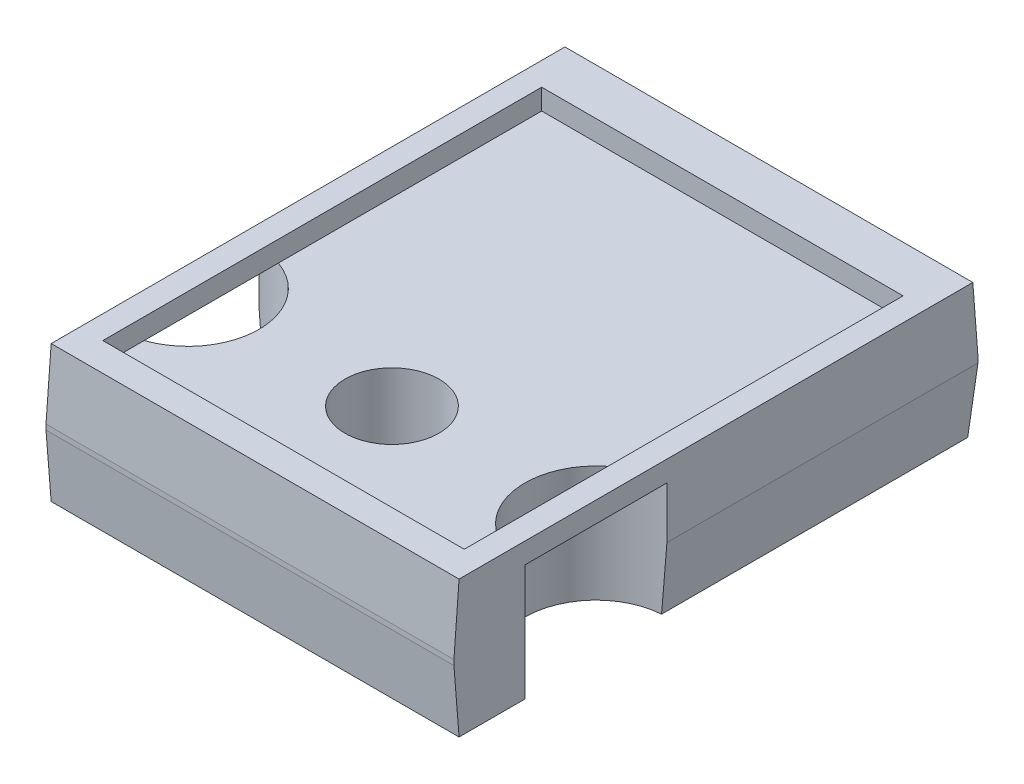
ISO-10303-21;
HEADER;
FILE_DESCRIPTION(('STEP AP214'),'2;1');
FILE_NAME('part.step','',(''),(''),'','','');
FILE_SCHEMA(('AUTOMOTIVE_DESIGN { 1 0 10303 214 1 1 1 1 }'));
ENDSEC;
DATA;
#1=APPLICATION_CONTEXT('core data for automotive mechanical design processes');
#2=APPLICATION_PROTOCOL_DEFINITION('international standard','automotive_design',2000,#1);
#3=PRODUCT_CONTEXT('',#1,'mechanical');
#4=PRODUCT('Part','Part','',(#3));
#5=PRODUCT_RELATED_PRODUCT_CATEGORY('part','',(#4));
#6=PRODUCT_DEFINITION_FORMATION('','',#4);
#7=PRODUCT_DEFINITION_CONTEXT('part definition',#1,'design');
#8=PRODUCT_DEFINITION('design','',#6,#7);
#9=PRODUCT_DEFINITION_SHAPE('','',#8);
#10=(LENGTH_UNIT() NAMED_UNIT(*) SI_UNIT(.MILLI.,.METRE.));
#11=(NAMED_UNIT(*) PLANE_ANGLE_UNIT() SI_UNIT($,.RADIAN.));
#12=(NAMED_UNIT(*) SI_UNIT($,.STERADIAN.) SOLID_ANGLE_UNIT());
#13=UNCERTAINTY_MEASURE_WITH_UNIT(LENGTH_MEASURE(1.E-05),#10,'distance_accuracy_value','');
#14=(GEOMETRIC_REPRESENTATION_CONTEXT(3) GLOBAL_UNCERTAINTY_ASSIGNED_CONTEXT((#13)) GLOBAL_UNIT_ASSIGNED_CONTEXT((#10,
#11,#12)) REPRESENTATION_CONTEXT('',''));
#15=CARTESIAN_POINT('',(0.,0.,0.));
#16=DIRECTION('',(0.,0.,1.));
#17=DIRECTION('',(1.,0.,0.));
#18=AXIS2_PLACEMENT_3D('',#15,#16,#17);
#19=CARTESIAN_POINT('',(14.9,4.5,6.3));
#20=DIRECTION('',(1.,0.,0.));
#21=DIRECTION('',(0.,0.,-1.));
#22=AXIS2_PLACEMENT_3D('',#19,#20,#21);
#23=PLANE('',#22);
#24=DIRECTION('',(0.,0.,-1.));
#25=VECTOR('',#24,1.);
#26=CARTESIAN_POINT('',(14.9,4.5,6.3));
#27=LINE('',#26,#25);
#28=CARTESIAN_POINT('',(14.9,4.5,23.3));
#29=VERTEX_POINT('',#28);
#30=CARTESIAN_POINT('',(14.9,4.5,21.6985572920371));
#31=VERTEX_POINT('',#30);
#32=EDGE_CURVE('E128',#29,#31,#27,.T.);
#33=ORIENTED_EDGE('',*,*,#32,.F.);
#34=DIRECTION('',(0.,1.,0.));
#35=VECTOR('',#34,1.);
#36=CARTESIAN_POINT('',(14.9,4.5,23.3));
#37=LINE('',#36,#35);
#38=CARTESIAN_POINT('',(14.9,5.3000000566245,23.3));
#39=VERTEX_POINT('',#38);
#40=EDGE_CURVE('E132',#29,#39,#37,.T.);
#41=ORIENTED_EDGE('',*,*,#40,.T.);
#42=DIRECTION('',(0.,0.,1.));
#43=VECTOR('',#42,1.);
#44=CARTESIAN_POINT('',(14.9,5.300000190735,4.3));
#45=LINE('',#44,#43);
#46=CARTESIAN_POINT('',(14.9,5.300000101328,6.3));
#47=VERTEX_POINT('',#46);
#48=EDGE_CURVE('E179',#47,#39,#45,.T.);
#49=ORIENTED_EDGE('',*,*,#48,.F.);
#50=DIRECTION('',(0.,1.,0.));
#51=VECTOR('',#50,1.);
#52=CARTESIAN_POINT('',(14.9,4.5,6.3));
#53=LINE('',#52,#51);
#54=CARTESIAN_POINT('',(14.9,4.5,6.3));
#55=VERTEX_POINT('',#54);
#56=EDGE_CURVE('E139',#55,#47,#53,.T.);
#57=ORIENTED_EDGE('',*,*,#56,.F.);
#58=DIRECTION('',(0.,0.,1.));
#59=VECTOR('',#58,1.);
#60=CARTESIAN_POINT('',(14.9,4.5,6.3));
#61=LINE('',#60,#59);
#62=CARTESIAN_POINT('',(14.9,4.5,16.5014427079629));
#63=VERTEX_POINT('',#62);
#64=EDGE_CURVE('E218',#63,#55,#61,.F.);
#65=ORIENTED_EDGE('',*,*,#64,.F.);
#66=DIRECTION('',(0.,0.,-1.));
#67=VECTOR('',#66,1.);
#68=CARTESIAN_POINT('',(14.9,4.5,19.1));
#69=LINE('',#68,#67);
#70=EDGE_CURVE('E135',#31,#63,#69,.T.);
#71=ORIENTED_EDGE('',*,*,#70,.F.);
#72=EDGE_LOOP('',(#33,#41,#49,#57,#65,#71));
#73=FACE_BOUND('',#72,.T.);
#74=ADVANCED_FACE('F16',(#73),#23,.F.);
#75=CARTESIAN_POINT('',(0.9,4.5,6.3));
#76=DIRECTION('',(0.,0.,1.));
#77=DIRECTION('',(1.,0.,0.));
#78=AXIS2_PLACEMENT_3D('',#75,#76,#77);
#79=PLANE('',#78);
#80=ORIENTED_EDGE('',*,*,#56,.T.);
#81=DIRECTION('',(1.,0.,0.));
#82=VECTOR('',#81,1.);
#83=CARTESIAN_POINT('',(0.,5.300000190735,6.3));
#84=LINE('',#83,#82);
#85=CARTESIAN_POINT('',(0.9,5.300000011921,6.3));
#86=VERTEX_POINT('',#85);
#87=EDGE_CURVE('E174',#86,#47,#84,.T.);
#88=ORIENTED_EDGE('',*,*,#87,.F.);
#89=DIRECTION('',(0.,1.,0.));
#90=VECTOR('',#89,1.);
#91=CARTESIAN_POINT('',(0.9,4.5,6.3));
#92=LINE('',#91,#90);
#93=CARTESIAN_POINT('',(0.9,4.5,6.3));
#94=VERTEX_POINT('',#93);
#95=EDGE_CURVE('E298',#94,#86,#92,.T.);
#96=ORIENTED_EDGE('',*,*,#95,.F.);
#97=DIRECTION('',(1.,0.,0.));
#98=VECTOR('',#97,1.);
#99=CARTESIAN_POINT('',(0.9,4.5,6.3));
#100=LINE('',#99,#98);
#101=EDGE_CURVE('E163',#55,#94,#100,.F.);
#102=ORIENTED_EDGE('',*,*,#101,.F.);
#103=EDGE_LOOP('',(#80,#88,#96,#102));
#104=FACE_BOUND('',#103,.T.);
#105=ADVANCED_FACE('F340',(#104),#79,.T.);
#106=CARTESIAN_POINT('',(0.9,4.5,6.3));
#107=DIRECTION('',(1.,0.,0.));
#108=DIRECTION('',(0.,0.,-1.));
#109=AXIS2_PLACEMENT_3D('',#106,#107,#108);
#110=PLANE('',#109);
#111=DIRECTION('',(0.,0.,-1.));
#112=VECTOR('',#111,1.);
#113=CARTESIAN_POINT('',(0.9,4.5,6.3));
#114=LINE('',#113,#112);
#115=CARTESIAN_POINT('',(0.9,4.5,23.3));
#116=VERTEX_POINT('',#115);
#117=CARTESIAN_POINT('',(0.9,4.5,21.6985572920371));
#118=VERTEX_POINT('',#117);
#119=EDGE_CURVE('E154',#116,#118,#114,.T.);
#120=ORIENTED_EDGE('',*,*,#119,.T.);
#121=DIRECTION('',(0.,0.,-1.));
#122=VECTOR('',#121,1.);
#123=CARTESIAN_POINT('',(0.9,4.5,19.1));
#124=LINE('',#123,#122);
#125=CARTESIAN_POINT('',(0.9,4.5,16.5014427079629));
#126=VERTEX_POINT('',#125);
#127=EDGE_CURVE('E239',#126,#118,#124,.F.);
#128=ORIENTED_EDGE('',*,*,#127,.F.);
#129=DIRECTION('',(0.,0.,1.));
#130=VECTOR('',#129,1.);
#131=CARTESIAN_POINT('',(0.9,4.5,6.3));
#132=LINE('',#131,#130);
#133=EDGE_CURVE('E157',#94,#126,#132,.T.);
#134=ORIENTED_EDGE('',*,*,#133,.F.);
#135=ORIENTED_EDGE('',*,*,#95,.T.);
#136=DIRECTION('',(0.,0.,1.));
#137=VECTOR('',#136,1.);
#138=CARTESIAN_POINT('',(0.9,5.300000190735,4.3));
#139=LINE('',#138,#137);
#140=CARTESIAN_POINT('',(0.9,5.3000000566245,23.3));
#141=VERTEX_POINT('',#140);
#142=EDGE_CURVE('E171',#141,#86,#139,.F.);
#143=ORIENTED_EDGE('',*,*,#142,.F.);
#144=DIRECTION('',(0.,1.,0.));
#145=VECTOR('',#144,1.);
#146=CARTESIAN_POINT('',(0.9,4.5,23.3));
#147=LINE('',#146,#145);
#148=EDGE_CURVE('E150',#141,#116,#147,.F.);
#149=ORIENTED_EDGE('',*,*,#148,.T.);
#150=EDGE_LOOP('',(#120,#128,#134,#135,#143,#149));
#151=FACE_BOUND('',#150,.T.);
#152=ADVANCED_FACE('F328',(#151),#110,.T.);
#153=CARTESIAN_POINT('',(0.9,4.5,23.3));
#154=DIRECTION('',(0.,0.,1.));
#155=DIRECTION('',(1.,0.,0.));
#156=AXIS2_PLACEMENT_3D('',#153,#154,#155);
#157=PLANE('',#156);
#158=ORIENTED_EDGE('',*,*,#40,.F.);
#159=DIRECTION('',(1.,0.,0.));
#160=VECTOR('',#159,1.);
#161=CARTESIAN_POINT('',(0.9,4.5,23.3));
#162=LINE('',#161,#160);
#163=EDGE_CURVE('E146',#116,#29,#162,.T.);
#164=ORIENTED_EDGE('',*,*,#163,.F.);
#165=ORIENTED_EDGE('',*,*,#148,.F.);
#166=DIRECTION('',(1.,0.,0.));
#167=VECTOR('',#166,1.);
#168=CARTESIAN_POINT('',(0.,5.300000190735,23.3));
#169=LINE('',#168,#167);
#170=EDGE_CURVE('E148',#39,#141,#169,.F.);
#171=ORIENTED_EDGE('',*,*,#170,.F.);
#172=EDGE_LOOP('',(#158,#164,#165,#171));
#173=FACE_BOUND('',#172,.T.);
#174=ADVANCED_FACE('F144',(#173),#157,.F.);
#175=CARTESIAN_POINT('',(0.,0.,4.3));
#176=DIRECTION('',(0.,0.,1.));
#177=DIRECTION('',(1.,0.,0.));
#178=AXIS2_PLACEMENT_3D('',#175,#176,#177);
#179=PLANE('',#178);
#180=DIRECTION('',(0.,1.,0.));
#181=VECTOR('',#180,1.);
#182=CARTESIAN_POINT('',(15.800000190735,0.,4.3));
#183=LINE('',#182,#181);
#184=CARTESIAN_POINT('',(15.800000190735,2.5,4.3));
#185=VERTEX_POINT('',#184);
#186=CARTESIAN_POINT('',(15.800000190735,2.70000019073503,4.30000000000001));
#187=VERTEX_POINT('',#186);
#188=EDGE_CURVE('E251',#185,#187,#183,.T.);
#189=ORIENTED_EDGE('',*,*,#188,.F.);
#190=DIRECTION('',(1.,0.,0.));
#191=VECTOR('',#190,1.);
#192=CARTESIAN_POINT('',(0.,2.5,4.29999999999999));
#193=LINE('',#192,#191);
#194=CARTESIAN_POINT('',(0.,2.5,4.3));
#195=VERTEX_POINT('',#194);
#196=EDGE_CURVE('E156',#195,#185,#193,.T.);
#197=ORIENTED_EDGE('',*,*,#196,.F.);
#198=DIRECTION('',(0.,1.,0.));
#199=VECTOR('',#198,1.);
#200=CARTESIAN_POINT('',(0.,0.,4.3));
#201=LINE('',#200,#199);
#202=CARTESIAN_POINT('',(0.,2.70000019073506,4.30000000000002));
#203=VERTEX_POINT('',#202);
#204=EDGE_CURVE('E149',#203,#195,#201,.F.);
#205=ORIENTED_EDGE('',*,*,#204,.F.);
#206=DIRECTION('',(1.,0.,0.));
#207=VECTOR('',#206,1.);
#208=CARTESIAN_POINT('',(0.,2.700000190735,4.30000000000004));
#209=LINE('',#208,#207);
#210=EDGE_CURVE('E238',#203,#187,#209,.T.);
#211=ORIENTED_EDGE('',*,*,#210,.T.);
#212=EDGE_LOOP('',(#189,#197,#205,#211));
#213=FACE_BOUND('',#212,.T.);
#214=ADVANCED_FACE('F432',(#213),#179,.F.);
#215=CARTESIAN_POINT('',(0.,4.5,19.1));
#216=DIRECTION('',(0.,-1.,0.));
#217=DIRECTION('',(0.,0.,-1.));
#218=AXIS2_PLACEMENT_3D('',#215,#216,#217);
#219=PLANE('',#218);
#220=DIRECTION('',(0.,0.,-1.));
#221=VECTOR('',#220,1.);
#222=CARTESIAN_POINT('',(0.,4.5,4.3));
#223=LINE('',#222,#221);
#224=CARTESIAN_POINT('',(0.,4.5,21.85));
#225=VERTEX_POINT('',#224);
#226=CARTESIAN_POINT('',(0.,4.5,16.35));
#227=VERTEX_POINT('',#226);
#228=EDGE_CURVE('E252',#225,#227,#223,.T.);
#229=ORIENTED_EDGE('',*,*,#228,.T.);
#230=CARTESIAN_POINT('',(0.,4.5,19.1));
#231=DIRECTION('',(0.,-1.,0.));
#232=DIRECTION('',(0.,0.,-1.));
#233=AXIS2_PLACEMENT_3D('',#230,#231,#232);
#234=CIRCLE('',#233,2.75);
#235=EDGE_CURVE('E215',#227,#126,#234,.T.);
#236=ORIENTED_EDGE('',*,*,#235,.T.);
#237=ORIENTED_EDGE('',*,*,#127,.T.);
#238=CARTESIAN_POINT('',(0.,4.5,19.1));
#239=DIRECTION('',(0.,-1.,0.));
#240=DIRECTION('',(0.,0.,-1.));
#241=AXIS2_PLACEMENT_3D('',#238,#239,#240);
#242=CIRCLE('',#241,2.75);
#243=EDGE_CURVE('E208',#118,#225,#242,.T.);
#244=ORIENTED_EDGE('',*,*,#243,.T.);
#245=EDGE_LOOP('',(#229,#236,#237,#244));
#246=FACE_BOUND('',#245,.T.);
#247=ADVANCED_FACE('F590',(#246),#219,.T.);
#248=CARTESIAN_POINT('',(0.,0.,24.599999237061));
#249=DIRECTION('',(0.,0.,1.));
#250=DIRECTION('',(1.,0.,0.));
#251=AXIS2_PLACEMENT_3D('',#248,#249,#250);
#252=PLANE('',#251);
#253=DIRECTION('',(0.,1.,0.));
#254=VECTOR('',#253,1.);
#255=CARTESIAN_POINT('',(15.800000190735,0.,24.599999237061));
#256=LINE('',#255,#254);
#257=CARTESIAN_POINT('',(15.800000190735,2.49999999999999,24.599999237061));
#258=VERTEX_POINT('',#257);
#259=CARTESIAN_POINT('',(15.800000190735,2.70000019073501,24.599999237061));
#260=VERTEX_POINT('',#259);
#261=EDGE_CURVE('E90',#258,#260,#256,.T.);
#262=ORIENTED_EDGE('',*,*,#261,.T.);
#263=DIRECTION('',(1.,0.,0.));
#264=VECTOR('',#263,1.);
#265=CARTESIAN_POINT('',(0.,2.700000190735,24.599999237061));
#266=LINE('',#265,#264);
#267=CARTESIAN_POINT('',(0.,2.70000019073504,24.599999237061));
#268=VERTEX_POINT('',#267);
#269=EDGE_CURVE('E183',#268,#260,#266,.T.);
#270=ORIENTED_EDGE('',*,*,#269,.F.);
#271=DIRECTION('',(0.,1.,0.));
#272=VECTOR('',#271,1.);
#273=CARTESIAN_POINT('',(0.,0.,24.599999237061));
#274=LINE('',#273,#272);
#275=CARTESIAN_POINT('',(0.,2.49999999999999,24.599999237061));
#276=VERTEX_POINT('',#275);
#277=EDGE_CURVE('E242',#268,#276,#274,.F.);
#278=ORIENTED_EDGE('',*,*,#277,.T.);
#279=DIRECTION('',(1.,0.,0.));
#280=VECTOR('',#279,1.);
#281=CARTESIAN_POINT('',(0.,2.5,24.599999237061));
#282=LINE('',#281,#280);
#283=EDGE_CURVE('E229',#276,#258,#282,.T.);
#284=ORIENTED_EDGE('',*,*,#283,.T.);
#285=EDGE_LOOP('',(#262,#270,#278,#284));
#286=FACE_BOUND('',#285,.T.);
#287=ADVANCED_FACE('F454',(#286),#252,.T.);
#288=CARTESIAN_POINT('',(0.,4.000000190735,4.4));
#289=DIRECTION('',(0.,-0.076696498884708,0.997054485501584));
#290=DIRECTION('',(0.,-0.997054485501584,-0.076696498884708));
#291=AXIS2_PLACEMENT_3D('',#288,#289,#290);
#292=PLANE('',#291);
#293=DIRECTION('',(1.,0.,0.));
#294=VECTOR('',#293,1.);
#295=CARTESIAN_POINT('',(0.,5.300000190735,4.5));
#296=LINE('',#295,#294);
#297=CARTESIAN_POINT('',(15.800000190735,5.300000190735,4.49999999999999));
#298=VERTEX_POINT('',#297);
#299=CARTESIAN_POINT('',(0.,5.300000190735,4.5));
#300=VERTEX_POINT('',#299);
#301=EDGE_CURVE('E236',#298,#300,#296,.F.);
#302=ORIENTED_EDGE('',*,*,#301,.F.);
#303=DIRECTION('',(0.,0.997054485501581,0.0766964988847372));
#304=VECTOR('',#303,1.);
#305=CARTESIAN_POINT('',(15.800000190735,2.700000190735,4.3));
#306=LINE('',#305,#304);
#307=EDGE_CURVE('E231',#187,#298,#306,.T.);
#308=ORIENTED_EDGE('',*,*,#307,.F.);
#309=ORIENTED_EDGE('',*,*,#210,.F.);
#310=DIRECTION('',(0.,0.997054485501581,0.0766964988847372));
#311=VECTOR('',#310,1.);
#312=CARTESIAN_POINT('',(0.,2.700000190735,4.3));
#313=LINE('',#312,#311);
#314=EDGE_CURVE('E273',#203,#300,#313,.T.);
#315=ORIENTED_EDGE('',*,*,#314,.T.);
#316=EDGE_LOOP('',(#302,#308,#309,#315));
#317=FACE_BOUND('',#316,.T.);
#318=ADVANCED_FACE('F448',(#317),#292,.F.);
#319=CARTESIAN_POINT('',(0.,5.300000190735,4.3));
#320=DIRECTION('',(0.,1.,0.));
#321=DIRECTION('',(0.,0.,1.));
#322=AXIS2_PLACEMENT_3D('',#319,#320,#321);
#323=PLANE('',#322);
#324=ORIENTED_EDGE('',*,*,#87,.T.);
#325=ORIENTED_EDGE('',*,*,#48,.T.);
#326=ORIENTED_EDGE('',*,*,#170,.T.);
#327=ORIENTED_EDGE('',*,*,#142,.T.);
#328=EDGE_LOOP('',(#324,#325,#326,#327));
#329=FACE_BOUND('',#328,.T.);
#330=DIRECTION('',(0.,0.,-1.));
#331=VECTOR('',#330,1.);
#332=CARTESIAN_POINT('',(0.,5.300000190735,4.3));
#333=LINE('',#332,#331);
#334=CARTESIAN_POINT('',(0.,5.300000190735,24.399999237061));
#335=VERTEX_POINT('',#334);
#336=EDGE_CURVE('E260',#300,#335,#333,.F.);
#337=ORIENTED_EDGE('',*,*,#336,.T.);
#338=DIRECTION('',(1.,0.,0.));
#339=VECTOR('',#338,1.);
#340=CARTESIAN_POINT('',(0.,5.300000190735,24.399999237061));
#341=LINE('',#340,#339);
#342=CARTESIAN_POINT('',(15.800000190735,5.300000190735,24.399999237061));
#343=VERTEX_POINT('',#342);
#344=EDGE_CURVE('E224',#343,#335,#341,.F.);
#345=ORIENTED_EDGE('',*,*,#344,.F.);
#346=DIRECTION('',(0.,0.,-1.));
#347=VECTOR('',#346,1.);
#348=CARTESIAN_POINT('',(15.800000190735,5.300000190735,4.3));
#349=LINE('',#348,#347);
#350=EDGE_CURVE('E310',#298,#343,#349,.F.);
#351=ORIENTED_EDGE('',*,*,#350,.F.);
#352=ORIENTED_EDGE('',*,*,#301,.T.);
#353=EDGE_LOOP('',(#337,#345,#351,#352));
#354=FACE_BOUND('',#353,.T.);
#355=ADVANCED_FACE('F332',(#329,#354),#323,.T.);
#356=CARTESIAN_POINT('',(0.,4.000000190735,24.499999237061));
#357=DIRECTION('',(0.,0.076696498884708,0.997054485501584));
#358=DIRECTION('',(0.,-0.997054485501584,0.076696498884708));
#359=AXIS2_PLACEMENT_3D('',#356,#357,#358);
#360=PLANE('',#359);
#361=ORIENTED_EDGE('',*,*,#344,.T.);
#362=DIRECTION('',(0.,-0.997054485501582,0.0766964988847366));
#363=VECTOR('',#362,1.);
#364=CARTESIAN_POINT('',(0.,5.300000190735,24.399999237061));
#365=LINE('',#364,#363);
#366=EDGE_CURVE('E246',#335,#268,#365,.T.);
#367=ORIENTED_EDGE('',*,*,#366,.T.);
#368=ORIENTED_EDGE('',*,*,#269,.T.);
#369=DIRECTION('',(0.,-0.997054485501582,0.0766964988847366));
#370=VECTOR('',#369,1.);
#371=CARTESIAN_POINT('',(15.800000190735,5.300000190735,24.399999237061));
#372=LINE('',#371,#370);
#373=EDGE_CURVE('E313',#343,#260,#372,.T.);
#374=ORIENTED_EDGE('',*,*,#373,.F.);
#375=EDGE_LOOP('',(#361,#367,#368,#374));
#376=FACE_BOUND('',#375,.T.);
#377=ADVANCED_FACE('F452',(#376),#360,.T.);
#378=CARTESIAN_POINT('',(15.8,4.5,19.1));
#379=DIRECTION('',(0.,-1.,0.));
#380=DIRECTION('',(0.,0.,-1.));
#381=AXIS2_PLACEMENT_3D('',#378,#379,#380);
#382=PLANE('',#381);
#383=ORIENTED_EDGE('',*,*,#70,.T.);
#384=CARTESIAN_POINT('',(15.8,4.5,19.1));
#385=DIRECTION('',(0.,-1.,0.));
#386=DIRECTION('',(0.,0.,-1.));
#387=AXIS2_PLACEMENT_3D('',#384,#385,#386);
#388=CIRCLE('',#387,2.75);
#389=CARTESIAN_POINT('',(15.8000000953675,4.5,16.35));
#390=VERTEX_POINT('',#389);
#391=EDGE_CURVE('E217',#63,#390,#388,.T.);
#392=ORIENTED_EDGE('',*,*,#391,.T.);
#393=DIRECTION('',(0.,0.,-1.));
#394=VECTOR('',#393,1.);
#395=CARTESIAN_POINT('',(15.800000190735,4.5,4.3));
#396=LINE('',#395,#394);
#397=CARTESIAN_POINT('',(15.800000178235,4.5,21.85));
#398=VERTEX_POINT('',#397);
#399=EDGE_CURVE('E227',#398,#390,#396,.T.);
#400=ORIENTED_EDGE('',*,*,#399,.F.);
#401=CARTESIAN_POINT('',(15.8,4.5,19.1));
#402=DIRECTION('',(0.,-1.,0.));
#403=DIRECTION('',(0.,0.,-1.));
#404=AXIS2_PLACEMENT_3D('',#401,#402,#403);
#405=CIRCLE('',#404,2.75);
#406=EDGE_CURVE('E19',#398,#31,#405,.T.);
#407=ORIENTED_EDGE('',*,*,#406,.T.);
#408=EDGE_LOOP('',(#383,#392,#400,#407));
#409=FACE_BOUND('',#408,.T.);
#410=ADVANCED_FACE('F344',(#409),#382,.T.);
#411=CARTESIAN_POINT('',(0.9,4.5,6.3));
#412=DIRECTION('',(0.,1.,0.));
#413=DIRECTION('',(0.,0.,1.));
#414=AXIS2_PLACEMENT_3D('',#411,#412,#413);
#415=PLANE('',#414);
#416=CARTESIAN_POINT('',(7.9,4.5,19.1));
#417=DIRECTION('',(0.,-1.,0.));
#418=DIRECTION('',(0.,0.,-1.));
#419=AXIS2_PLACEMENT_3D('',#416,#417,#418);
#420=CIRCLE('',#419,1.820000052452);
#421=CARTESIAN_POINT('',(7.9,4.5,17.279999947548));
#422=VERTEX_POINT('',#421);
#423=EDGE_CURVE('E197',#422,#422,#420,.T.);
#424=ORIENTED_EDGE('',*,*,#423,.T.);
#425=EDGE_LOOP('',(#424));
#426=FACE_BOUND('',#425,.T.);
#427=ORIENTED_EDGE('',*,*,#32,.T.);
#428=CARTESIAN_POINT('',(15.8,4.5,19.1));
#429=DIRECTION('',(0.,-1.,0.));
#430=DIRECTION('',(0.,0.,-1.));
#431=AXIS2_PLACEMENT_3D('',#428,#429,#430);
#432=CIRCLE('',#431,2.75);
#433=EDGE_CURVE('E204',#31,#63,#432,.T.);
#434=ORIENTED_EDGE('',*,*,#433,.T.);
#435=ORIENTED_EDGE('',*,*,#64,.T.);
#436=ORIENTED_EDGE('',*,*,#101,.T.);
#437=ORIENTED_EDGE('',*,*,#133,.T.);
#438=CARTESIAN_POINT('',(0.,4.5,19.1));
#439=DIRECTION('',(0.,-1.,0.));
#440=DIRECTION('',(0.,0.,-1.));
#441=AXIS2_PLACEMENT_3D('',#438,#439,#440);
#442=CIRCLE('',#441,2.75);
#443=EDGE_CURVE('E211',#126,#118,#442,.T.);
#444=ORIENTED_EDGE('',*,*,#443,.T.);
#445=ORIENTED_EDGE('',*,*,#119,.F.);
#446=ORIENTED_EDGE('',*,*,#163,.T.);
#447=EDGE_LOOP('',(#427,#434,#435,#436,#437,#444,#445,#446));
#448=FACE_BOUND('',#447,.T.);
#449=ADVANCED_FACE('F152',(#426,#448),#415,.T.);
#450=CARTESIAN_POINT('',(0.,1.25,4.4));
#451=DIRECTION('',(0.,-0.0797452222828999,-0.996815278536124));
#452=DIRECTION('',(0.,0.996815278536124,-0.0797452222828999));
#453=AXIS2_PLACEMENT_3D('',#450,#451,#452);
#454=PLANE('',#453);
#455=ORIENTED_EDGE('',*,*,#196,.T.);
#456=DIRECTION('',(-0.0794928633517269,-0.993660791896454,0.0794928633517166));
#457=VECTOR('',#456,1.);
#458=CARTESIAN_POINT('',(15.800000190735,2.5,4.3));
#459=LINE('',#458,#457);
#460=CARTESIAN_POINT('',(15.600000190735,0.,4.5));
#461=VERTEX_POINT('',#460);
#462=EDGE_CURVE('E203',#185,#461,#459,.T.);
#463=ORIENTED_EDGE('',*,*,#462,.T.);
#464=DIRECTION('',(1.,0.,0.));
#465=VECTOR('',#464,1.);
#466=CARTESIAN_POINT('',(0.,0.,4.5));
#467=LINE('',#466,#465);
#468=CARTESIAN_POINT('',(0.200000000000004,0.,4.5));
#469=VERTEX_POINT('',#468);
#470=EDGE_CURVE('E200',#461,#469,#467,.F.);
#471=ORIENTED_EDGE('',*,*,#470,.T.);
#472=DIRECTION('',(0.0794928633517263,-0.993660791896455,0.0794928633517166));
#473=VECTOR('',#472,1.);
#474=CARTESIAN_POINT('',(0.,2.5,4.3));
#475=LINE('',#474,#473);
#476=EDGE_CURVE('E160',#195,#469,#475,.T.);
#477=ORIENTED_EDGE('',*,*,#476,.F.);
#478=EDGE_LOOP('',(#455,#463,#471,#477));
#479=FACE_BOUND('',#478,.T.);
#480=ADVANCED_FACE('F433',(#479),#454,.T.);
#481=CARTESIAN_POINT('',(0.1,1.25,4.5));
#482=DIRECTION('',(-0.996815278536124,-0.0797452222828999,0.));
#483=DIRECTION('',(0.0797452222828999,-0.996815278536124,0.));
#484=AXIS2_PLACEMENT_3D('',#481,#482,#483);
#485=PLANE('',#484);
#486=DIRECTION('',(0.,0.,-1.));
#487=VECTOR('',#486,1.);
#488=CARTESIAN_POINT('',(0.,2.5,4.3));
#489=LINE('',#488,#487);
#490=CARTESIAN_POINT('',(0.,2.49999999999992,16.35));
#491=VERTEX_POINT('',#490);
#492=EDGE_CURVE('E257',#491,#195,#489,.T.);
#493=ORIENTED_EDGE('',*,*,#492,.T.);
#494=ORIENTED_EDGE('',*,*,#476,.T.);
#495=DIRECTION('',(0.,0.,1.));
#496=VECTOR('',#495,1.);
#497=CARTESIAN_POINT('',(0.2,0.,4.3));
#498=LINE('',#497,#496);
#499=CARTESIAN_POINT('',(0.200000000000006,0.,16.3572823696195));
#500=VERTEX_POINT('',#499);
#501=EDGE_CURVE('E196',#469,#500,#498,.T.);
#502=ORIENTED_EDGE('',*,*,#501,.T.);
#503=CARTESIAN_POINT('',(0.,2.49999999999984,19.1));
#504=DIRECTION('',(-0.996815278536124,-0.0797452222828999,0.));
#505=DIRECTION('',(0.0797452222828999,-0.996815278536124,0.));
#506=AXIS2_PLACEMENT_3D('',#503,#504,#505);
#507=ELLIPSE('',#506,34.4848245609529,2.75);
#508=EDGE_CURVE('E213',#500,#491,#507,.F.);
#509=ORIENTED_EDGE('',*,*,#508,.T.);
#510=EDGE_LOOP('',(#493,#494,#502,#509));
#511=FACE_BOUND('',#510,.T.);
#512=ADVANCED_FACE('F426',(#511),#485,.T.);
#513=CARTESIAN_POINT('',(0.,4.5,19.1));
#514=DIRECTION('',(0.,-1.,0.));
#515=DIRECTION('',(0.,0.,-1.));
#516=AXIS2_PLACEMENT_3D('',#513,#514,#515);
#517=CYLINDRICAL_SURFACE('',#516,2.75);
#518=CARTESIAN_POINT('',(0.,0.,19.1));
#519=DIRECTION('',(0.,-1.,0.));
#520=DIRECTION('',(0.,0.,-1.));
#521=AXIS2_PLACEMENT_3D('',#518,#519,#520);
#522=CIRCLE('',#521,2.75);
#523=CARTESIAN_POINT('',(0.,0.,21.85));
#524=VERTEX_POINT('',#523);
#525=EDGE_CURVE('E192',#500,#524,#522,.T.);
#526=ORIENTED_EDGE('',*,*,#525,.T.);
#527=DIRECTION('',(0.,1.,0.));
#528=VECTOR('',#527,1.);
#529=CARTESIAN_POINT('',(0.,0.,21.85));
#530=LINE('',#529,#528);
#531=EDGE_CURVE('E245',#524,#225,#530,.T.);
#532=ORIENTED_EDGE('',*,*,#531,.T.);
#533=ORIENTED_EDGE('',*,*,#243,.F.);
#534=ORIENTED_EDGE('',*,*,#443,.F.);
#535=ORIENTED_EDGE('',*,*,#235,.F.);
#536=DIRECTION('',(0.,1.,0.));
#537=VECTOR('',#536,1.);
#538=CARTESIAN_POINT('',(0.,0.,16.35));
#539=LINE('',#538,#537);
#540=EDGE_CURVE('E210',#227,#491,#539,.F.);
#541=ORIENTED_EDGE('',*,*,#540,.T.);
#542=ORIENTED_EDGE('',*,*,#508,.F.);
#543=EDGE_LOOP('',(#526,#532,#533,#534,#535,#541,#542));
#544=FACE_BOUND('',#543,.T.);
#545=ADVANCED_FACE('F422',(#544),#517,.F.);
#546=CARTESIAN_POINT('',(0.,0.,4.3));
#547=DIRECTION('',(1.,0.,0.));
#548=DIRECTION('',(0.,0.,-1.));
#549=AXIS2_PLACEMENT_3D('',#546,#547,#548);
#550=PLANE('',#549);
#551=ORIENTED_EDGE('',*,*,#531,.F.);
#552=DIRECTION('',(0.,0.,1.));
#553=VECTOR('',#552,1.);
#554=CARTESIAN_POINT('',(0.,0.,4.3));
#555=LINE('',#554,#553);
#556=CARTESIAN_POINT('',(0.,0.,24.399999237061));
#557=VERTEX_POINT('',#556);
#558=EDGE_CURVE('E195',#524,#557,#555,.T.);
#559=ORIENTED_EDGE('',*,*,#558,.T.);
#560=DIRECTION('',(0.,0.996815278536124,0.0797452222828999));
#561=VECTOR('',#560,1.);
#562=CARTESIAN_POINT('',(0.,1.25,24.499999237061));
#563=LINE('',#562,#561);
#564=EDGE_CURVE('E232',#557,#276,#563,.T.);
#565=ORIENTED_EDGE('',*,*,#564,.T.);
#566=ORIENTED_EDGE('',*,*,#277,.F.);
#567=ORIENTED_EDGE('',*,*,#366,.F.);
#568=ORIENTED_EDGE('',*,*,#336,.F.);
#569=ORIENTED_EDGE('',*,*,#314,.F.);
#570=ORIENTED_EDGE('',*,*,#204,.T.);
#571=ORIENTED_EDGE('',*,*,#492,.F.);
#572=ORIENTED_EDGE('',*,*,#540,.F.);
#573=ORIENTED_EDGE('',*,*,#228,.F.);
#574=EDGE_LOOP('',(#551,#559,#565,#566,#567,#568,#569,#570,#571,#572,#573));
#575=FACE_BOUND('',#574,.T.);
#576=ADVANCED_FACE('F415',(#575),#550,.F.);
#577=CARTESIAN_POINT('',(0.,1.25,24.499999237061));
#578=DIRECTION('',(0.,0.0797452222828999,-0.996815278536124));
#579=DIRECTION('',(0.,0.996815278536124,0.0797452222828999));
#580=AXIS2_PLACEMENT_3D('',#577,#578,#579);
#581=PLANE('',#580);
#582=DIRECTION('',(0.,-0.996815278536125,-0.0797452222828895));
#583=VECTOR('',#582,1.);
#584=CARTESIAN_POINT('',(15.800000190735,2.5,24.599999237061));
#585=LINE('',#584,#583);
#586=CARTESIAN_POINT('',(15.800000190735,0.,24.399999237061));
#587=VERTEX_POINT('',#586);
#588=EDGE_CURVE('E317',#258,#587,#585,.T.);
#589=ORIENTED_EDGE('',*,*,#588,.F.);
#590=ORIENTED_EDGE('',*,*,#283,.F.);
#591=ORIENTED_EDGE('',*,*,#564,.F.);
#592=DIRECTION('',(1.,0.,0.));
#593=VECTOR('',#592,1.);
#594=CARTESIAN_POINT('',(0.,0.,24.399999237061));
#595=LINE('',#594,#593);
#596=EDGE_CURVE('E358',#557,#587,#595,.T.);
#597=ORIENTED_EDGE('',*,*,#596,.T.);
#598=EDGE_LOOP('',(#589,#590,#591,#597));
#599=FACE_BOUND('',#598,.T.);
#600=ADVANCED_FACE('F458',(#599),#581,.F.);
#601=CARTESIAN_POINT('',(15.800000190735,0.,4.3));
#602=DIRECTION('',(1.,0.,0.));
#603=DIRECTION('',(0.,0.,-1.));
#604=AXIS2_PLACEMENT_3D('',#601,#602,#603);
#605=PLANE('',#604);
#606=DIRECTION('',(0.,-1.,0.));
#607=VECTOR('',#606,1.);
#608=CARTESIAN_POINT('',(15.800000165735,4.5,21.85));
#609=LINE('',#608,#607);
#610=CARTESIAN_POINT('',(15.800000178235,0.,21.85));
#611=VERTEX_POINT('',#610);
#612=EDGE_CURVE('E207',#611,#398,#609,.F.);
#613=ORIENTED_EDGE('',*,*,#612,.T.);
#614=ORIENTED_EDGE('',*,*,#399,.T.);
#615=DIRECTION('',(0.,-1.,0.));
#616=VECTOR('',#615,1.);
#617=CARTESIAN_POINT('',(15.8,4.5,16.35));
#618=LINE('',#617,#616);
#619=CARTESIAN_POINT('',(15.8000000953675,2.49999880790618,16.35));
#620=VERTEX_POINT('',#619);
#621=EDGE_CURVE('E206',#390,#620,#618,.T.);
#622=ORIENTED_EDGE('',*,*,#621,.T.);
#623=DIRECTION('',(0.,0.,1.));
#624=VECTOR('',#623,1.);
#625=CARTESIAN_POINT('',(15.800000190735,2.5,4.5));
#626=LINE('',#625,#624);
#627=EDGE_CURVE('E201',#620,#185,#626,.F.);
#628=ORIENTED_EDGE('',*,*,#627,.T.);
#629=ORIENTED_EDGE('',*,*,#188,.T.);
#630=ORIENTED_EDGE('',*,*,#307,.T.);
#631=ORIENTED_EDGE('',*,*,#350,.T.);
#632=ORIENTED_EDGE('',*,*,#373,.T.);
#633=ORIENTED_EDGE('',*,*,#261,.F.);
#634=ORIENTED_EDGE('',*,*,#588,.T.);
#635=DIRECTION('',(0.,0.,1.));
#636=VECTOR('',#635,1.);
#637=CARTESIAN_POINT('',(15.800000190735,0.,4.3));
#638=LINE('',#637,#636);
#639=EDGE_CURVE('E191',#587,#611,#638,.F.);
#640=ORIENTED_EDGE('',*,*,#639,.T.);
#641=EDGE_LOOP('',(#613,#614,#622,#628,#629,#630,#631,#632,#633,#634,#640));
#642=FACE_BOUND('',#641,.T.);
#643=ADVANCED_FACE('F347',(#642),#605,.T.);
#644=CARTESIAN_POINT('',(15.8,4.5,19.1));
#645=DIRECTION('',(0.,-1.,0.));
#646=DIRECTION('',(0.,0.,-1.));
#647=AXIS2_PLACEMENT_3D('',#644,#645,#646);
#648=CYLINDRICAL_SURFACE('',#647,2.75);
#649=ORIENTED_EDGE('',*,*,#621,.F.);
#650=ORIENTED_EDGE('',*,*,#391,.F.);
#651=ORIENTED_EDGE('',*,*,#433,.F.);
#652=ORIENTED_EDGE('',*,*,#406,.F.);
#653=ORIENTED_EDGE('',*,*,#612,.F.);
#654=CARTESIAN_POINT('',(15.8,0.,19.1));
#655=DIRECTION('',(0.,-1.,0.));
#656=DIRECTION('',(0.,0.,-1.));
#657=AXIS2_PLACEMENT_3D('',#654,#655,#656);
#658=CIRCLE('',#657,2.75);
#659=CARTESIAN_POINT('',(15.600000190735,0.,16.357282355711));
#660=VERTEX_POINT('',#659);
#661=EDGE_CURVE('E188',#611,#660,#658,.T.);
#662=ORIENTED_EDGE('',*,*,#661,.T.);
#663=CARTESIAN_POINT('',(15.8,2.49999761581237,19.1));
#664=DIRECTION('',(-0.996815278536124,0.0797452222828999,0.));
#665=DIRECTION('',(-0.0797452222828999,-0.996815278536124,0.));
#666=AXIS2_PLACEMENT_3D('',#663,#664,#665);
#667=ELLIPSE('',#666,34.4848245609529,2.75);
#668=EDGE_CURVE('E34',#660,#620,#667,.F.);
#669=ORIENTED_EDGE('',*,*,#668,.T.);
#670=EDGE_LOOP('',(#649,#650,#651,#652,#653,#662,#669));
#671=FACE_BOUND('',#670,.T.);
#672=ADVANCED_FACE('F343',(#671),#648,.F.);
#673=CARTESIAN_POINT('',(15.700000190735,1.25,4.5));
#674=DIRECTION('',(-0.996815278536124,0.0797452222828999,0.));
#675=DIRECTION('',(-0.0797452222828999,-0.996815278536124,0.));
#676=AXIS2_PLACEMENT_3D('',#673,#674,#675);
#677=PLANE('',#676);
#678=ORIENTED_EDGE('',*,*,#668,.F.);
#679=DIRECTION('',(0.,0.,1.));
#680=VECTOR('',#679,1.);
#681=CARTESIAN_POINT('',(15.600000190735,0.,4.3));
#682=LINE('',#681,#680);
#683=EDGE_CURVE('E25',#660,#461,#682,.F.);
#684=ORIENTED_EDGE('',*,*,#683,.T.);
#685=ORIENTED_EDGE('',*,*,#462,.F.);
#686=ORIENTED_EDGE('',*,*,#627,.F.);
#687=EDGE_LOOP('',(#678,#684,#685,#686));
#688=FACE_BOUND('',#687,.T.);
#689=ADVANCED_FACE('F400',(#688),#677,.F.);
#690=CARTESIAN_POINT('',(7.9,4.5,19.1));
#691=DIRECTION('',(0.,-1.,0.));
#692=DIRECTION('',(0.,0.,-1.));
#693=AXIS2_PLACEMENT_3D('',#690,#691,#692);
#694=CYLINDRICAL_SURFACE('',#693,1.820000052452);
#695=ORIENTED_EDGE('',*,*,#423,.F.);
#696=EDGE_LOOP('',(#695));
#697=FACE_BOUND('',#696,.T.);
#698=CARTESIAN_POINT('',(7.9,0.,19.1));
#699=DIRECTION('',(0.,-1.,0.));
#700=DIRECTION('',(0.,0.,-1.));
#701=AXIS2_PLACEMENT_3D('',#698,#699,#700);
#702=CIRCLE('',#701,1.820000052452);
#703=CARTESIAN_POINT('',(7.9,0.,17.279999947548));
#704=VERTEX_POINT('',#703);
#705=EDGE_CURVE('E10',#704,#704,#702,.T.);
#706=ORIENTED_EDGE('',*,*,#705,.T.);
#707=EDGE_LOOP('',(#706));
#708=FACE_BOUND('',#707,.T.);
#709=ADVANCED_FACE('F470',(#697,#708),#694,.F.);
#710=CARTESIAN_POINT('',(0.,0.,4.3));
#711=DIRECTION('',(0.,1.,0.));
#712=DIRECTION('',(0.,0.,1.));
#713=AXIS2_PLACEMENT_3D('',#710,#711,#712);
#714=PLANE('',#713);
#715=ORIENTED_EDGE('',*,*,#705,.F.);
#716=EDGE_LOOP('',(#715));
#717=FACE_BOUND('',#716,.T.);
#718=ORIENTED_EDGE('',*,*,#661,.F.);
#719=ORIENTED_EDGE('',*,*,#639,.F.);
#720=ORIENTED_EDGE('',*,*,#596,.F.);
#721=ORIENTED_EDGE('',*,*,#558,.F.);
#722=ORIENTED_EDGE('',*,*,#525,.F.);
#723=ORIENTED_EDGE('',*,*,#501,.F.);
#724=ORIENTED_EDGE('',*,*,#470,.F.);
#725=ORIENTED_EDGE('',*,*,#683,.F.);
#726=EDGE_LOOP('',(#718,#719,#720,#721,#722,#723,#724,#725));
#727=FACE_BOUND('',#726,.T.);
#728=ADVANCED_FACE('F402',(#717,#727),#714,.F.);
#729=CLOSED_SHELL('',(#74,#105,#152,#174,#214,#247,#287,#318,#355,#377,#410,#449,#480,#512,#545,
#576,#600,#643,#672,#689,#709,#728));
#730=MANIFOLD_SOLID_BREP('B1',#729);
#731=ADVANCED_BREP_SHAPE_REPRESENTATION('',(#18,#730),#14);
#732=SHAPE_DEFINITION_REPRESENTATION(#9,#731);
ENDSEC;
END-ISO-10303-21;
